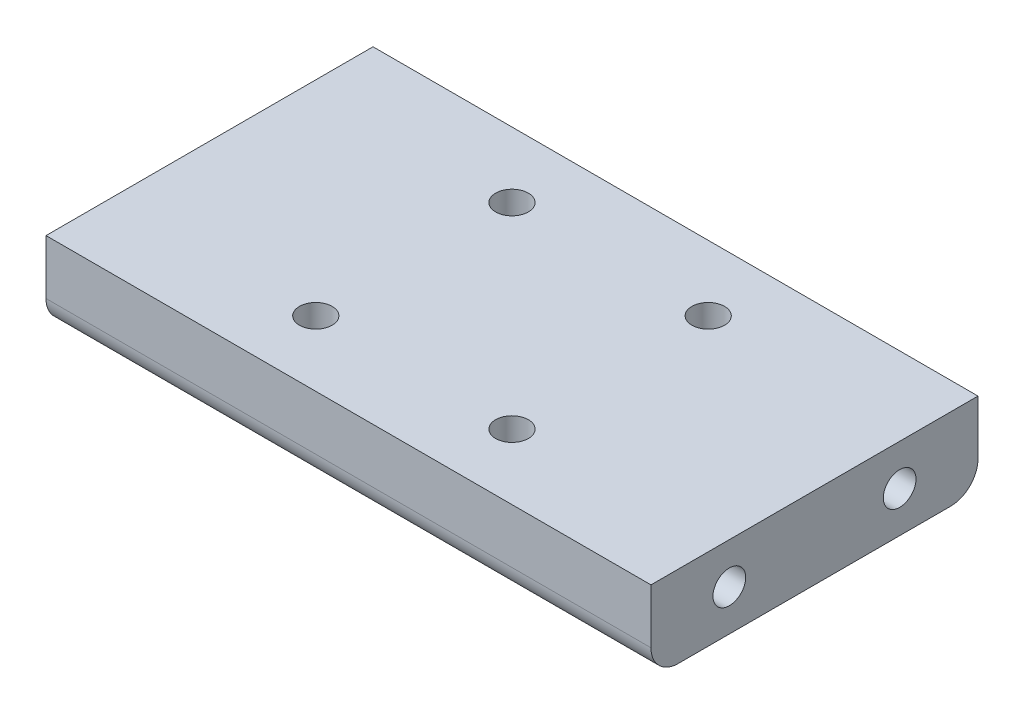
ISO-10303-21;
HEADER;
FILE_DESCRIPTION(('STEP AP214'),'2;1');
FILE_NAME('part.step','',(''),(''),'','','');
FILE_SCHEMA(('AUTOMOTIVE_DESIGN { 1 0 10303 214 1 1 1 1 }'));
ENDSEC;
DATA;
#1=APPLICATION_CONTEXT('core data for automotive mechanical design processes');
#2=APPLICATION_PROTOCOL_DEFINITION('international standard','automotive_design',2000,#1);
#3=PRODUCT_CONTEXT('',#1,'mechanical');
#4=PRODUCT('Part','Part','',(#3));
#5=PRODUCT_RELATED_PRODUCT_CATEGORY('part','',(#4));
#6=PRODUCT_DEFINITION_FORMATION('','',#4);
#7=PRODUCT_DEFINITION_CONTEXT('part definition',#1,'design');
#8=PRODUCT_DEFINITION('design','',#6,#7);
#9=PRODUCT_DEFINITION_SHAPE('','',#8);
#10=(LENGTH_UNIT() NAMED_UNIT(*) SI_UNIT(.MILLI.,.METRE.));
#11=(NAMED_UNIT(*) PLANE_ANGLE_UNIT() SI_UNIT($,.RADIAN.));
#12=(NAMED_UNIT(*) SI_UNIT($,.STERADIAN.) SOLID_ANGLE_UNIT());
#13=UNCERTAINTY_MEASURE_WITH_UNIT(LENGTH_MEASURE(1.E-05),#10,'distance_accuracy_value','');
#14=(GEOMETRIC_REPRESENTATION_CONTEXT(3) GLOBAL_UNCERTAINTY_ASSIGNED_CONTEXT((#13)) GLOBAL_UNIT_ASSIGNED_CONTEXT((#10,
#11,#12)) REPRESENTATION_CONTEXT('',''));
#15=CARTESIAN_POINT('',(0.,0.,0.));
#16=DIRECTION('',(0.,0.,1.));
#17=DIRECTION('',(1.,0.,0.));
#18=AXIS2_PLACEMENT_3D('',#15,#16,#17);
#19=CARTESIAN_POINT('',(55.5,15.,30.));
#20=DIRECTION('',(-1.,0.,0.));
#21=DIRECTION('',(0.,0.,1.));
#22=AXIS2_PLACEMENT_3D('',#19,#20,#21);
#23=PLANE('',#22);
#24=CARTESIAN_POINT('',(55.5,7.5,-15.625));
#25=DIRECTION('',(1.,0.,0.));
#26=DIRECTION('',(0.,0.,-1.));
#27=AXIS2_PLACEMENT_3D('',#24,#25,#26);
#28=CIRCLE('',#27,3.);
#29=CARTESIAN_POINT('',(55.5,7.5,-18.625));
#30=VERTEX_POINT('',#29);
#31=EDGE_CURVE('E299',#30,#30,#28,.T.);
#32=ORIENTED_EDGE('',*,*,#31,.F.);
#33=EDGE_LOOP('',(#32));
#34=FACE_BOUND('',#33,.T.);
#35=CARTESIAN_POINT('',(55.5,7.5,15.625));
#36=DIRECTION('',(1.,0.,0.));
#37=DIRECTION('',(0.,0.,-1.));
#38=AXIS2_PLACEMENT_3D('',#35,#36,#37);
#39=CIRCLE('',#38,3.);
#40=CARTESIAN_POINT('',(55.5,7.5,12.625));
#41=VERTEX_POINT('',#40);
#42=EDGE_CURVE('E307',#41,#41,#39,.T.);
#43=ORIENTED_EDGE('',*,*,#42,.F.);
#44=EDGE_LOOP('',(#43));
#45=FACE_BOUND('',#44,.T.);
#46=DIRECTION('',(0.,0.,-1.));
#47=VECTOR('',#46,1.);
#48=CARTESIAN_POINT('',(55.5,0.,30.));
#49=LINE('',#48,#47);
#50=CARTESIAN_POINT('',(55.5,0.,25.));
#51=VERTEX_POINT('',#50);
#52=CARTESIAN_POINT('',(55.5,0.,-25.));
#53=VERTEX_POINT('',#52);
#54=EDGE_CURVE('E159',#51,#53,#49,.T.);
#55=ORIENTED_EDGE('',*,*,#54,.T.);
#56=CARTESIAN_POINT('',(55.5,5.,-25.));
#57=DIRECTION('',(-1.,0.,0.));
#58=DIRECTION('',(0.,0.,1.));
#59=AXIS2_PLACEMENT_3D('',#56,#57,#58);
#60=CIRCLE('',#59,5.);
#61=CARTESIAN_POINT('',(55.5,5.,-30.));
#62=VERTEX_POINT('',#61);
#63=EDGE_CURVE('E11',#53,#62,#60,.F.);
#64=ORIENTED_EDGE('',*,*,#63,.T.);
#65=DIRECTION('',(0.,-1.,0.));
#66=VECTOR('',#65,1.);
#67=CARTESIAN_POINT('',(55.5,15.,-30.));
#68=LINE('',#67,#66);
#69=CARTESIAN_POINT('',(55.5,15.,-30.));
#70=VERTEX_POINT('',#69);
#71=EDGE_CURVE('E103',#70,#62,#68,.T.);
#72=ORIENTED_EDGE('',*,*,#71,.F.);
#73=DIRECTION('',(0.,0.,-1.));
#74=VECTOR('',#73,1.);
#75=CARTESIAN_POINT('',(55.5,15.,30.));
#76=LINE('',#75,#74);
#77=CARTESIAN_POINT('',(55.5,15.,30.));
#78=VERTEX_POINT('',#77);
#79=EDGE_CURVE('E110',#78,#70,#76,.T.);
#80=ORIENTED_EDGE('',*,*,#79,.F.);
#81=DIRECTION('',(0.,-1.,0.));
#82=VECTOR('',#81,1.);
#83=CARTESIAN_POINT('',(55.5,15.,30.));
#84=LINE('',#83,#82);
#85=CARTESIAN_POINT('',(55.5,5.,30.));
#86=VERTEX_POINT('',#85);
#87=EDGE_CURVE('E156',#78,#86,#84,.T.);
#88=ORIENTED_EDGE('',*,*,#87,.T.);
#89=CARTESIAN_POINT('',(55.5,5.,25.));
#90=DIRECTION('',(-1.,0.,0.));
#91=DIRECTION('',(0.,0.,1.));
#92=AXIS2_PLACEMENT_3D('',#89,#90,#91);
#93=CIRCLE('',#92,5.);
#94=EDGE_CURVE('E129',#86,#51,#93,.F.);
#95=ORIENTED_EDGE('',*,*,#94,.T.);
#96=EDGE_LOOP('',(#55,#64,#72,#80,#88,#95));
#97=FACE_BOUND('',#96,.T.);
#98=ADVANCED_FACE('F45',(#34,#45,#97),#23,.F.);
#99=CARTESIAN_POINT('',(-55.5,15.,-30.));
#100=DIRECTION('',(0.,0.,1.));
#101=DIRECTION('',(1.,0.,0.));
#102=AXIS2_PLACEMENT_3D('',#99,#100,#101);
#103=PLANE('',#102);
#104=ORIENTED_EDGE('',*,*,#71,.T.);
#105=DIRECTION('',(-1.,0.,0.));
#106=VECTOR('',#105,1.);
#107=CARTESIAN_POINT('',(-55.5,5.,-30.));
#108=LINE('',#107,#106);
#109=CARTESIAN_POINT('',(-55.5,5.,-30.));
#110=VERTEX_POINT('',#109);
#111=EDGE_CURVE('E144',#62,#110,#108,.T.);
#112=ORIENTED_EDGE('',*,*,#111,.T.);
#113=DIRECTION('',(0.,-1.,0.));
#114=VECTOR('',#113,1.);
#115=CARTESIAN_POINT('',(-55.5,15.,-30.));
#116=LINE('',#115,#114);
#117=CARTESIAN_POINT('',(-55.5,15.,-30.));
#118=VERTEX_POINT('',#117);
#119=EDGE_CURVE('E105',#118,#110,#116,.T.);
#120=ORIENTED_EDGE('',*,*,#119,.F.);
#121=DIRECTION('',(-1.,0.,0.));
#122=VECTOR('',#121,1.);
#123=CARTESIAN_POINT('',(-55.5,15.,-30.));
#124=LINE('',#123,#122);
#125=EDGE_CURVE('E98',#70,#118,#124,.T.);
#126=ORIENTED_EDGE('',*,*,#125,.F.);
#127=EDGE_LOOP('',(#104,#112,#120,#126));
#128=FACE_BOUND('',#127,.T.);
#129=ADVANCED_FACE('F100',(#128),#103,.F.);
#130=CARTESIAN_POINT('',(-55.5,15.,30.));
#131=DIRECTION('',(1.,0.,0.));
#132=DIRECTION('',(0.,0.,-1.));
#133=AXIS2_PLACEMENT_3D('',#130,#131,#132);
#134=PLANE('',#133);
#135=CARTESIAN_POINT('',(-55.5,7.5,-15.625));
#136=DIRECTION('',(1.,0.,0.));
#137=DIRECTION('',(0.,0.,-1.));
#138=AXIS2_PLACEMENT_3D('',#135,#136,#137);
#139=CIRCLE('',#138,3.);
#140=CARTESIAN_POINT('',(-55.5,7.5,-18.625));
#141=VERTEX_POINT('',#140);
#142=EDGE_CURVE('E285',#141,#141,#139,.T.);
#143=ORIENTED_EDGE('',*,*,#142,.T.);
#144=EDGE_LOOP('',(#143));
#145=FACE_BOUND('',#144,.T.);
#146=CARTESIAN_POINT('',(-55.5,7.5,15.625));
#147=DIRECTION('',(1.,0.,0.));
#148=DIRECTION('',(0.,0.,-1.));
#149=AXIS2_PLACEMENT_3D('',#146,#147,#148);
#150=CIRCLE('',#149,3.);
#151=CARTESIAN_POINT('',(-55.5,7.5,12.625));
#152=VERTEX_POINT('',#151);
#153=EDGE_CURVE('E291',#152,#152,#150,.T.);
#154=ORIENTED_EDGE('',*,*,#153,.T.);
#155=EDGE_LOOP('',(#154));
#156=FACE_BOUND('',#155,.T.);
#157=ORIENTED_EDGE('',*,*,#119,.T.);
#158=CARTESIAN_POINT('',(-55.5,5.,-25.));
#159=DIRECTION('',(1.,0.,0.));
#160=DIRECTION('',(0.,0.,-1.));
#161=AXIS2_PLACEMENT_3D('',#158,#159,#160);
#162=CIRCLE('',#161,5.);
#163=CARTESIAN_POINT('',(-55.5,0.,-25.));
#164=VERTEX_POINT('',#163);
#165=EDGE_CURVE('E68',#110,#164,#162,.F.);
#166=ORIENTED_EDGE('',*,*,#165,.T.);
#167=DIRECTION('',(0.,0.,1.));
#168=VECTOR('',#167,1.);
#169=CARTESIAN_POINT('',(-55.5,0.,30.));
#170=LINE('',#169,#168);
#171=CARTESIAN_POINT('',(-55.5,0.,25.));
#172=VERTEX_POINT('',#171);
#173=EDGE_CURVE('E120',#164,#172,#170,.T.);
#174=ORIENTED_EDGE('',*,*,#173,.T.);
#175=CARTESIAN_POINT('',(-55.5,5.,25.));
#176=DIRECTION('',(1.,0.,0.));
#177=DIRECTION('',(0.,0.,-1.));
#178=AXIS2_PLACEMENT_3D('',#175,#176,#177);
#179=CIRCLE('',#178,5.);
#180=CARTESIAN_POINT('',(-55.5,5.,30.));
#181=VERTEX_POINT('',#180);
#182=EDGE_CURVE('E141',#172,#181,#179,.F.);
#183=ORIENTED_EDGE('',*,*,#182,.T.);
#184=DIRECTION('',(0.,-1.,0.));
#185=VECTOR('',#184,1.);
#186=CARTESIAN_POINT('',(-55.5,15.,30.));
#187=LINE('',#186,#185);
#188=CARTESIAN_POINT('',(-55.5,15.,30.));
#189=VERTEX_POINT('',#188);
#190=EDGE_CURVE('E131',#189,#181,#187,.T.);
#191=ORIENTED_EDGE('',*,*,#190,.F.);
#192=DIRECTION('',(0.,0.,1.));
#193=VECTOR('',#192,1.);
#194=CARTESIAN_POINT('',(-55.5,15.,30.));
#195=LINE('',#194,#193);
#196=EDGE_CURVE('E109',#118,#189,#195,.T.);
#197=ORIENTED_EDGE('',*,*,#196,.F.);
#198=EDGE_LOOP('',(#157,#166,#174,#183,#191,#197));
#199=FACE_BOUND('',#198,.T.);
#200=ADVANCED_FACE('F150',(#145,#156,#199),#134,.F.);
#201=CARTESIAN_POINT('',(-55.5,15.,30.));
#202=DIRECTION('',(0.,0.,-1.));
#203=DIRECTION('',(-1.,0.,0.));
#204=AXIS2_PLACEMENT_3D('',#201,#202,#203);
#205=PLANE('',#204);
#206=ORIENTED_EDGE('',*,*,#190,.T.);
#207=DIRECTION('',(1.,0.,0.));
#208=VECTOR('',#207,1.);
#209=CARTESIAN_POINT('',(55.5,5.,30.));
#210=LINE('',#209,#208);
#211=EDGE_CURVE('E124',#181,#86,#210,.T.);
#212=ORIENTED_EDGE('',*,*,#211,.T.);
#213=ORIENTED_EDGE('',*,*,#87,.F.);
#214=DIRECTION('',(1.,0.,0.));
#215=VECTOR('',#214,1.);
#216=CARTESIAN_POINT('',(-55.5,15.,30.));
#217=LINE('',#216,#215);
#218=EDGE_CURVE('E115',#189,#78,#217,.T.);
#219=ORIENTED_EDGE('',*,*,#218,.F.);
#220=EDGE_LOOP('',(#206,#212,#213,#219));
#221=FACE_BOUND('',#220,.T.);
#222=ADVANCED_FACE('F169',(#221),#205,.F.);
#223=CARTESIAN_POINT('',(0.,15.,0.));
#224=DIRECTION('',(0.,-1.,0.));
#225=DIRECTION('',(0.,0.,-1.));
#226=AXIS2_PLACEMENT_3D('',#223,#224,#225);
#227=PLANE('',#226);
#228=CARTESIAN_POINT('',(18.,15.,18.));
#229=DIRECTION('',(0.,1.,0.));
#230=DIRECTION('',(0.,0.,1.));
#231=AXIS2_PLACEMENT_3D('',#228,#229,#230);
#232=CIRCLE('',#231,3.);
#233=CARTESIAN_POINT('',(18.,15.,21.));
#234=VERTEX_POINT('',#233);
#235=EDGE_CURVE('E275',#234,#234,#232,.T.);
#236=ORIENTED_EDGE('',*,*,#235,.F.);
#237=EDGE_LOOP('',(#236));
#238=FACE_BOUND('',#237,.T.);
#239=CARTESIAN_POINT('',(18.,15.,-18.));
#240=DIRECTION('',(0.,1.,0.));
#241=DIRECTION('',(0.,0.,1.));
#242=AXIS2_PLACEMENT_3D('',#239,#240,#241);
#243=CIRCLE('',#242,3.);
#244=CARTESIAN_POINT('',(18.,15.,-15.));
#245=VERTEX_POINT('',#244);
#246=EDGE_CURVE('E265',#245,#245,#243,.T.);
#247=ORIENTED_EDGE('',*,*,#246,.F.);
#248=EDGE_LOOP('',(#247));
#249=FACE_BOUND('',#248,.T.);
#250=CARTESIAN_POINT('',(-18.,15.,-18.));
#251=DIRECTION('',(0.,1.,0.));
#252=DIRECTION('',(0.,0.,1.));
#253=AXIS2_PLACEMENT_3D('',#250,#251,#252);
#254=CIRCLE('',#253,3.);
#255=CARTESIAN_POINT('',(-18.,15.,-15.));
#256=VERTEX_POINT('',#255);
#257=EDGE_CURVE('E255',#256,#256,#254,.T.);
#258=ORIENTED_EDGE('',*,*,#257,.F.);
#259=EDGE_LOOP('',(#258));
#260=FACE_BOUND('',#259,.T.);
#261=CARTESIAN_POINT('',(-18.,15.,18.));
#262=DIRECTION('',(0.,1.,0.));
#263=DIRECTION('',(0.,0.,1.));
#264=AXIS2_PLACEMENT_3D('',#261,#262,#263);
#265=CIRCLE('',#264,3.);
#266=CARTESIAN_POINT('',(-18.,15.,21.));
#267=VERTEX_POINT('',#266);
#268=EDGE_CURVE('E258',#267,#267,#265,.T.);
#269=ORIENTED_EDGE('',*,*,#268,.F.);
#270=EDGE_LOOP('',(#269));
#271=FACE_BOUND('',#270,.T.);
#272=ORIENTED_EDGE('',*,*,#79,.T.);
#273=ORIENTED_EDGE('',*,*,#125,.T.);
#274=ORIENTED_EDGE('',*,*,#196,.T.);
#275=ORIENTED_EDGE('',*,*,#218,.T.);
#276=EDGE_LOOP('',(#272,#273,#274,#275));
#277=FACE_BOUND('',#276,.T.);
#278=ADVANCED_FACE('F113',(#238,#249,#260,#271,#277),#227,.F.);
#279=CARTESIAN_POINT('',(0.,0.,0.));
#280=DIRECTION('',(0.,-1.,0.));
#281=DIRECTION('',(0.,0.,-1.));
#282=AXIS2_PLACEMENT_3D('',#279,#280,#281);
#283=PLANE('',#282);
#284=CARTESIAN_POINT('',(18.,0.,18.));
#285=DIRECTION('',(0.,1.,0.));
#286=DIRECTION('',(0.,0.,1.));
#287=AXIS2_PLACEMENT_3D('',#284,#285,#286);
#288=CIRCLE('',#287,3.);
#289=CARTESIAN_POINT('',(18.,0.,21.));
#290=VERTEX_POINT('',#289);
#291=EDGE_CURVE('E279',#290,#290,#288,.T.);
#292=ORIENTED_EDGE('',*,*,#291,.T.);
#293=EDGE_LOOP('',(#292));
#294=FACE_BOUND('',#293,.T.);
#295=CARTESIAN_POINT('',(18.,0.,-18.));
#296=DIRECTION('',(0.,1.,0.));
#297=DIRECTION('',(0.,0.,1.));
#298=AXIS2_PLACEMENT_3D('',#295,#296,#297);
#299=CIRCLE('',#298,3.);
#300=CARTESIAN_POINT('',(18.,0.,-15.));
#301=VERTEX_POINT('',#300);
#302=EDGE_CURVE('E271',#301,#301,#299,.T.);
#303=ORIENTED_EDGE('',*,*,#302,.T.);
#304=EDGE_LOOP('',(#303));
#305=FACE_BOUND('',#304,.T.);
#306=CARTESIAN_POINT('',(-18.,0.,-18.));
#307=DIRECTION('',(0.,1.,0.));
#308=DIRECTION('',(0.,0.,1.));
#309=AXIS2_PLACEMENT_3D('',#306,#307,#308);
#310=CIRCLE('',#309,3.);
#311=CARTESIAN_POINT('',(-18.,0.,-15.));
#312=VERTEX_POINT('',#311);
#313=EDGE_CURVE('E252',#312,#312,#310,.T.);
#314=ORIENTED_EDGE('',*,*,#313,.T.);
#315=EDGE_LOOP('',(#314));
#316=FACE_BOUND('',#315,.T.);
#317=CARTESIAN_POINT('',(-18.,0.,18.));
#318=DIRECTION('',(0.,1.,0.));
#319=DIRECTION('',(0.,0.,1.));
#320=AXIS2_PLACEMENT_3D('',#317,#318,#319);
#321=CIRCLE('',#320,3.);
#322=CARTESIAN_POINT('',(-18.,0.,21.));
#323=VERTEX_POINT('',#322);
#324=EDGE_CURVE('E263',#323,#323,#321,.T.);
#325=ORIENTED_EDGE('',*,*,#324,.T.);
#326=EDGE_LOOP('',(#325));
#327=FACE_BOUND('',#326,.T.);
#328=ORIENTED_EDGE('',*,*,#173,.F.);
#329=DIRECTION('',(-1.,0.,0.));
#330=VECTOR('',#329,1.);
#331=CARTESIAN_POINT('',(55.5,0.,-25.));
#332=LINE('',#331,#330);
#333=EDGE_CURVE('E54',#164,#53,#332,.F.);
#334=ORIENTED_EDGE('',*,*,#333,.T.);
#335=ORIENTED_EDGE('',*,*,#54,.F.);
#336=DIRECTION('',(1.,0.,0.));
#337=VECTOR('',#336,1.);
#338=CARTESIAN_POINT('',(-55.5,0.,25.));
#339=LINE('',#338,#337);
#340=EDGE_CURVE('E137',#51,#172,#339,.F.);
#341=ORIENTED_EDGE('',*,*,#340,.T.);
#342=EDGE_LOOP('',(#328,#334,#335,#341));
#343=FACE_BOUND('',#342,.T.);
#344=ADVANCED_FACE('F174',(#294,#305,#316,#327,#343),#283,.T.);
#345=CARTESIAN_POINT('',(45.5,7.5,15.625));
#346=DIRECTION('',(1.,0.,0.));
#347=DIRECTION('',(0.,0.,-1.));
#348=AXIS2_PLACEMENT_3D('',#345,#346,#347);
#349=CYLINDRICAL_SURFACE('',#348,3.);
#350=CARTESIAN_POINT('',(45.5,7.5,15.625));
#351=DIRECTION('',(1.,0.,0.));
#352=DIRECTION('',(0.,0.,-1.));
#353=AXIS2_PLACEMENT_3D('',#350,#351,#352);
#354=CIRCLE('',#353,3.);
#355=CARTESIAN_POINT('',(45.5,7.5,12.625));
#356=VERTEX_POINT('',#355);
#357=EDGE_CURVE('E162',#356,#356,#354,.T.);
#358=ORIENTED_EDGE('',*,*,#357,.F.);
#359=EDGE_LOOP('',(#358));
#360=FACE_BOUND('',#359,.T.);
#361=ORIENTED_EDGE('',*,*,#42,.T.);
#362=EDGE_LOOP('',(#361));
#363=FACE_BOUND('',#362,.T.);
#364=ADVANCED_FACE('F203',(#360,#363),#349,.F.);
#365=CARTESIAN_POINT('',(45.5,7.5,15.625));
#366=DIRECTION('',(1.,0.,0.));
#367=DIRECTION('',(0.,0.,-1.));
#368=AXIS2_PLACEMENT_3D('',#365,#366,#367);
#369=PLANE('',#368);
#370=ORIENTED_EDGE('',*,*,#357,.T.);
#371=EDGE_LOOP('',(#370));
#372=FACE_BOUND('',#371,.T.);
#373=ADVANCED_FACE('F209',(#372),#369,.T.);
#374=CARTESIAN_POINT('',(45.5,7.5,-15.625));
#375=DIRECTION('',(1.,0.,0.));
#376=DIRECTION('',(0.,0.,-1.));
#377=AXIS2_PLACEMENT_3D('',#374,#375,#376);
#378=CYLINDRICAL_SURFACE('',#377,3.);
#379=CARTESIAN_POINT('',(45.5,7.5,-15.625));
#380=DIRECTION('',(1.,0.,0.));
#381=DIRECTION('',(0.,0.,-1.));
#382=AXIS2_PLACEMENT_3D('',#379,#380,#381);
#383=CIRCLE('',#382,3.);
#384=CARTESIAN_POINT('',(45.5,7.5,-18.625));
#385=VERTEX_POINT('',#384);
#386=EDGE_CURVE('E303',#385,#385,#383,.T.);
#387=ORIENTED_EDGE('',*,*,#386,.F.);
#388=EDGE_LOOP('',(#387));
#389=FACE_BOUND('',#388,.T.);
#390=ORIENTED_EDGE('',*,*,#31,.T.);
#391=EDGE_LOOP('',(#390));
#392=FACE_BOUND('',#391,.T.);
#393=ADVANCED_FACE('F213',(#389,#392),#378,.F.);
#394=CARTESIAN_POINT('',(45.5,7.5,-15.625));
#395=DIRECTION('',(1.,0.,0.));
#396=DIRECTION('',(0.,0.,-1.));
#397=AXIS2_PLACEMENT_3D('',#394,#395,#396);
#398=PLANE('',#397);
#399=ORIENTED_EDGE('',*,*,#386,.T.);
#400=EDGE_LOOP('',(#399));
#401=FACE_BOUND('',#400,.T.);
#402=ADVANCED_FACE('F217',(#401),#398,.T.);
#403=CARTESIAN_POINT('',(-45.5,7.5,15.625));
#404=DIRECTION('',(-1.,0.,0.));
#405=DIRECTION('',(0.,0.,1.));
#406=AXIS2_PLACEMENT_3D('',#403,#404,#405);
#407=CYLINDRICAL_SURFACE('',#406,3.);
#408=CARTESIAN_POINT('',(-45.5,7.5,15.625));
#409=DIRECTION('',(1.,0.,0.));
#410=DIRECTION('',(0.,0.,-1.));
#411=AXIS2_PLACEMENT_3D('',#408,#409,#410);
#412=CIRCLE('',#411,3.);
#413=CARTESIAN_POINT('',(-45.5,7.5,12.625));
#414=VERTEX_POINT('',#413);
#415=EDGE_CURVE('E295',#414,#414,#412,.T.);
#416=ORIENTED_EDGE('',*,*,#415,.T.);
#417=EDGE_LOOP('',(#416));
#418=FACE_BOUND('',#417,.T.);
#419=ORIENTED_EDGE('',*,*,#153,.F.);
#420=EDGE_LOOP('',(#419));
#421=FACE_BOUND('',#420,.T.);
#422=ADVANCED_FACE('F221',(#418,#421),#407,.F.);
#423=CARTESIAN_POINT('',(-45.5,7.5,15.625));
#424=DIRECTION('',(-1.,0.,0.));
#425=DIRECTION('',(0.,0.,-1.));
#426=AXIS2_PLACEMENT_3D('',#423,#424,#425);
#427=PLANE('',#426);
#428=ORIENTED_EDGE('',*,*,#415,.F.);
#429=EDGE_LOOP('',(#428));
#430=FACE_BOUND('',#429,.T.);
#431=ADVANCED_FACE('F225',(#430),#427,.T.);
#432=CARTESIAN_POINT('',(-45.5,7.5,-15.625));
#433=DIRECTION('',(-1.,0.,0.));
#434=DIRECTION('',(0.,0.,1.));
#435=AXIS2_PLACEMENT_3D('',#432,#433,#434);
#436=CYLINDRICAL_SURFACE('',#435,3.);
#437=CARTESIAN_POINT('',(-45.5,7.5,-15.625));
#438=DIRECTION('',(1.,0.,0.));
#439=DIRECTION('',(0.,0.,-1.));
#440=AXIS2_PLACEMENT_3D('',#437,#438,#439);
#441=CIRCLE('',#440,3.);
#442=CARTESIAN_POINT('',(-45.5,7.5,-18.625));
#443=VERTEX_POINT('',#442);
#444=EDGE_CURVE('E287',#443,#443,#441,.T.);
#445=ORIENTED_EDGE('',*,*,#444,.T.);
#446=EDGE_LOOP('',(#445));
#447=FACE_BOUND('',#446,.T.);
#448=ORIENTED_EDGE('',*,*,#142,.F.);
#449=EDGE_LOOP('',(#448));
#450=FACE_BOUND('',#449,.T.);
#451=ADVANCED_FACE('F229',(#447,#450),#436,.F.);
#452=CARTESIAN_POINT('',(-45.5,7.5,-15.625));
#453=DIRECTION('',(-1.,0.,0.));
#454=DIRECTION('',(0.,0.,-1.));
#455=AXIS2_PLACEMENT_3D('',#452,#453,#454);
#456=PLANE('',#455);
#457=ORIENTED_EDGE('',*,*,#444,.F.);
#458=EDGE_LOOP('',(#457));
#459=FACE_BOUND('',#458,.T.);
#460=ADVANCED_FACE('F186',(#459),#456,.T.);
#461=CARTESIAN_POINT('',(-55.5,5.,25.));
#462=DIRECTION('',(-1.,0.,0.));
#463=DIRECTION('',(0.,0.,1.));
#464=AXIS2_PLACEMENT_3D('',#461,#462,#463);
#465=CYLINDRICAL_SURFACE('',#464,5.);
#466=ORIENTED_EDGE('',*,*,#182,.F.);
#467=ORIENTED_EDGE('',*,*,#340,.F.);
#468=ORIENTED_EDGE('',*,*,#94,.F.);
#469=ORIENTED_EDGE('',*,*,#211,.F.);
#470=EDGE_LOOP('',(#466,#467,#468,#469));
#471=FACE_BOUND('',#470,.T.);
#472=ADVANCED_FACE('F172',(#471),#465,.T.);
#473=CARTESIAN_POINT('',(-55.5,5.,-25.));
#474=DIRECTION('',(1.,0.,0.));
#475=DIRECTION('',(0.,0.,-1.));
#476=AXIS2_PLACEMENT_3D('',#473,#474,#475);
#477=CYLINDRICAL_SURFACE('',#476,5.);
#478=ORIENTED_EDGE('',*,*,#63,.F.);
#479=ORIENTED_EDGE('',*,*,#333,.F.);
#480=ORIENTED_EDGE('',*,*,#165,.F.);
#481=ORIENTED_EDGE('',*,*,#111,.F.);
#482=EDGE_LOOP('',(#478,#479,#480,#481));
#483=FACE_BOUND('',#482,.T.);
#484=ADVANCED_FACE('F47',(#483),#477,.T.);
#485=CARTESIAN_POINT('',(-18.,0.,18.));
#486=DIRECTION('',(0.,1.,0.));
#487=DIRECTION('',(0.,0.,1.));
#488=AXIS2_PLACEMENT_3D('',#485,#486,#487);
#489=CYLINDRICAL_SURFACE('',#488,3.);
#490=ORIENTED_EDGE('',*,*,#324,.F.);
#491=EDGE_LOOP('',(#490));
#492=FACE_BOUND('',#491,.T.);
#493=ORIENTED_EDGE('',*,*,#268,.T.);
#494=EDGE_LOOP('',(#493));
#495=FACE_BOUND('',#494,.T.);
#496=ADVANCED_FACE('F176',(#492,#495),#489,.F.);
#497=CARTESIAN_POINT('',(-18.,0.,-18.));
#498=DIRECTION('',(0.,1.,0.));
#499=DIRECTION('',(0.,0.,1.));
#500=AXIS2_PLACEMENT_3D('',#497,#498,#499);
#501=CYLINDRICAL_SURFACE('',#500,3.);
#502=ORIENTED_EDGE('',*,*,#313,.F.);
#503=EDGE_LOOP('',(#502));
#504=FACE_BOUND('',#503,.T.);
#505=ORIENTED_EDGE('',*,*,#257,.T.);
#506=EDGE_LOOP('',(#505));
#507=FACE_BOUND('',#506,.T.);
#508=ADVANCED_FACE('F182',(#504,#507),#501,.F.);
#509=CARTESIAN_POINT('',(18.,0.,-18.));
#510=DIRECTION('',(0.,1.,0.));
#511=DIRECTION('',(0.,0.,1.));
#512=AXIS2_PLACEMENT_3D('',#509,#510,#511);
#513=CYLINDRICAL_SURFACE('',#512,3.);
#514=ORIENTED_EDGE('',*,*,#302,.F.);
#515=EDGE_LOOP('',(#514));
#516=FACE_BOUND('',#515,.T.);
#517=ORIENTED_EDGE('',*,*,#246,.T.);
#518=EDGE_LOOP('',(#517));
#519=FACE_BOUND('',#518,.T.);
#520=ADVANCED_FACE('F240',(#516,#519),#513,.F.);
#521=CARTESIAN_POINT('',(18.,0.,18.));
#522=DIRECTION('',(0.,1.,0.));
#523=DIRECTION('',(0.,0.,1.));
#524=AXIS2_PLACEMENT_3D('',#521,#522,#523);
#525=CYLINDRICAL_SURFACE('',#524,3.);
#526=ORIENTED_EDGE('',*,*,#291,.F.);
#527=EDGE_LOOP('',(#526));
#528=FACE_BOUND('',#527,.T.);
#529=ORIENTED_EDGE('',*,*,#235,.T.);
#530=EDGE_LOOP('',(#529));
#531=FACE_BOUND('',#530,.T.);
#532=ADVANCED_FACE('F237',(#528,#531),#525,.F.);
#533=CLOSED_SHELL('',(#98,#129,#200,#222,#278,#344,#364,#373,#393,#402,#422,#431,#451,#460,#472,
#484,#496,#508,#520,#532));
#534=MANIFOLD_SOLID_BREP('B2',#533);
#535=ADVANCED_BREP_SHAPE_REPRESENTATION('',(#18,#534),#14);
#536=SHAPE_DEFINITION_REPRESENTATION(#9,#535);
ENDSEC;
END-ISO-10303-21;
